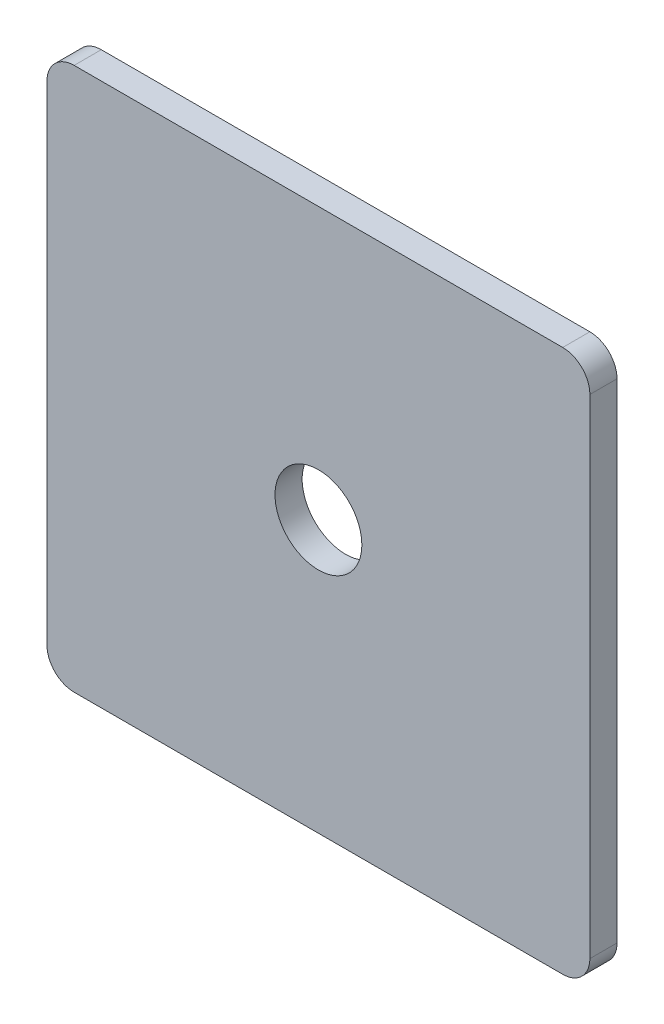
from build123d import *

# Parameters (mm, degrees)
ESQUISSE1_W             = 100
ESQUISSE1_H             = 100
BOSS_EXTRU_1_DEPTH      = 5
ESQUISSE3_R             = 8
ENL_V_MAT_EXTRU_1_DEPTH = 5
CONG_1_R                = 5


with BuildPart() as part:
    # Esquisse1 → Boss.-Extru.1 (new body)
    with BuildSketch(Plane.XY):
        with Locations((50, 50)):
            Rectangle(ESQUISSE1_W, ESQUISSE1_H)
    extrude(amount=BOSS_EXTRU_1_DEPTH)

    # Esquisse3 → Enl_v. mat.-Extru.1 (cut)
    with BuildSketch(Plane.XY.offset(5)):
        with Locations((50, 50)):
            Circle(ESQUISSE3_R)
    extrude(amount=-ENL_V_MAT_EXTRU_1_DEPTH, mode=Mode.SUBTRACT)

    # Cong_1
    cong_1_edges = [part.edges().sort_by_distance(p)[0] for p in [
        (0, 100, 2.5),
        (100, 100, 2.5),
        (100, 0, 2.5),
        (0, 0, 2.5),
    ]]
    fillet(cong_1_edges, radius=CONG_1_R)


solid = part.part
